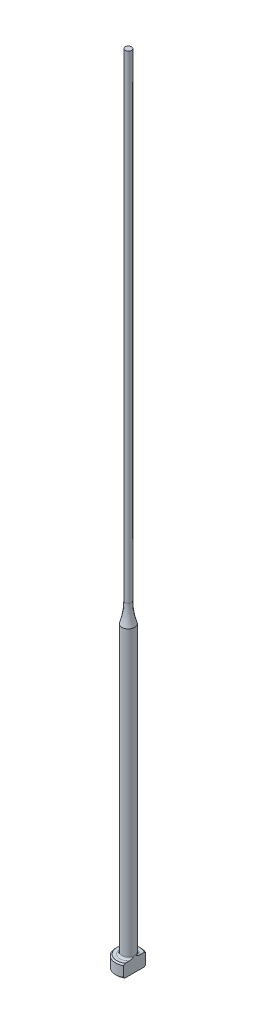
ISO-10303-21;
HEADER;
FILE_DESCRIPTION(('STEP AP214'),'2;1');
FILE_NAME('part.step','',(''),(''),'','','');
FILE_SCHEMA(('AUTOMOTIVE_DESIGN { 1 0 10303 214 1 1 1 1 }'));
ENDSEC;
DATA;
#1=APPLICATION_CONTEXT('core data for automotive mechanical design processes');
#2=APPLICATION_PROTOCOL_DEFINITION('international standard','automotive_design',2000,#1);
#3=PRODUCT_CONTEXT('',#1,'mechanical');
#4=PRODUCT('Part','Part','',(#3));
#5=PRODUCT_RELATED_PRODUCT_CATEGORY('part','',(#4));
#6=PRODUCT_DEFINITION_FORMATION('','',#4);
#7=PRODUCT_DEFINITION_CONTEXT('part definition',#1,'design');
#8=PRODUCT_DEFINITION('design','',#6,#7);
#9=PRODUCT_DEFINITION_SHAPE('','',#8);
#10=(LENGTH_UNIT() NAMED_UNIT(*) SI_UNIT(.MILLI.,.METRE.));
#11=(NAMED_UNIT(*) PLANE_ANGLE_UNIT() SI_UNIT($,.RADIAN.));
#12=(NAMED_UNIT(*) SI_UNIT($,.STERADIAN.) SOLID_ANGLE_UNIT());
#13=UNCERTAINTY_MEASURE_WITH_UNIT(LENGTH_MEASURE(1.E-05),#10,'distance_accuracy_value','');
#14=(GEOMETRIC_REPRESENTATION_CONTEXT(3) GLOBAL_UNCERTAINTY_ASSIGNED_CONTEXT((#13)) GLOBAL_UNIT_ASSIGNED_CONTEXT((#10,
#11,#12)) REPRESENTATION_CONTEXT('',''));
#15=CARTESIAN_POINT('',(0.,0.,0.));
#16=DIRECTION('',(0.,0.,1.));
#17=DIRECTION('',(1.,0.,0.));
#18=AXIS2_PLACEMENT_3D('',#15,#16,#17);
#19=CARTESIAN_POINT('',(-1.99999999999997,2.,0.));
#20=DIRECTION('',(0.,1.,0.));
#21=DIRECTION('',(0.,0.,1.));
#22=AXIS2_PLACEMENT_3D('',#19,#20,#21);
#23=PLANE('',#22);
#24=CARTESIAN_POINT('',(0.,2.,0.));
#25=DIRECTION('',(0.,1.,0.));
#26=DIRECTION('',(0.,0.,1.));
#27=AXIS2_PLACEMENT_3D('',#24,#25,#26);
#28=CIRCLE('',#27,1.79999999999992);
#29=CARTESIAN_POINT('',(0.999999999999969,2.,-1.4966629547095));
#30=VERTEX_POINT('',#29);
#31=CARTESIAN_POINT('',(0.999999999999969,2.,1.4966629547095));
#32=VERTEX_POINT('',#31);
#33=EDGE_CURVE('E187',#30,#32,#28,.T.);
#34=ORIENTED_EDGE('',*,*,#33,.T.);
#35=DIRECTION('',(0.,0.,-1.));
#36=VECTOR('',#35,1.);
#37=CARTESIAN_POINT('',(0.999999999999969,2.,0.));
#38=LINE('',#37,#36);
#39=CARTESIAN_POINT('',(0.999999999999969,2.00000000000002,0.830662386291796));
#40=VERTEX_POINT('',#39);
#41=EDGE_CURVE('E57',#32,#40,#38,.T.);
#42=ORIENTED_EDGE('',*,*,#41,.T.);
#43=CARTESIAN_POINT('',(0.,2.,0.));
#44=DIRECTION('',(0.,1.,0.));
#45=DIRECTION('',(0.,0.,1.));
#46=AXIS2_PLACEMENT_3D('',#43,#44,#45);
#47=CIRCLE('',#46,1.29999999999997);
#48=CARTESIAN_POINT('',(0.999999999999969,2.00000000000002,-0.830662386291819));
#49=VERTEX_POINT('',#48);
#50=EDGE_CURVE('E108',#40,#49,#47,.F.);
#51=ORIENTED_EDGE('',*,*,#50,.T.);
#52=EDGE_CURVE('E137',#49,#30,#38,.T.);
#53=ORIENTED_EDGE('',*,*,#52,.T.);
#54=EDGE_LOOP('',(#34,#42,#51,#53));
#55=FACE_BOUND('',#54,.T.);
#56=ADVANCED_FACE('F32',(#55),#23,.T.);
#57=CARTESIAN_POINT('',(0.,259.958771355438,0.));
#58=DIRECTION('',(0.,1.,0.));
#59=DIRECTION('',(0.,0.,1.));
#60=AXIS2_PLACEMENT_3D('',#57,#58,#59);
#61=CYLINDRICAL_SURFACE('',#60,1.99999999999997);
#62=CARTESIAN_POINT('',(0.,1.79999999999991,0.));
#63=DIRECTION('',(0.,1.,0.));
#64=DIRECTION('',(0.,0.,1.));
#65=AXIS2_PLACEMENT_3D('',#62,#63,#64);
#66=CIRCLE('',#65,1.99999999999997);
#67=CARTESIAN_POINT('',(0.999999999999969,1.79999999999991,1.73205080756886));
#68=VERTEX_POINT('',#67);
#69=CARTESIAN_POINT('',(0.999999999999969,1.79999999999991,-1.73205080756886));
#70=VERTEX_POINT('',#69);
#71=EDGE_CURVE('E105',#68,#70,#66,.F.);
#72=ORIENTED_EDGE('',*,*,#71,.T.);
#73=DIRECTION('',(0.,-1.,0.));
#74=VECTOR('',#73,1.);
#75=CARTESIAN_POINT('',(0.999999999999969,125.,-1.73205080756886));
#76=LINE('',#75,#74);
#77=CARTESIAN_POINT('',(0.999999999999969,0.199999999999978,-1.73205080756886));
#78=VERTEX_POINT('',#77);
#79=EDGE_CURVE('E193',#70,#78,#76,.T.);
#80=ORIENTED_EDGE('',*,*,#79,.T.);
#81=CARTESIAN_POINT('',(0.,0.199999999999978,0.));
#82=DIRECTION('',(0.,-1.,0.));
#83=DIRECTION('',(0.,0.,-1.));
#84=AXIS2_PLACEMENT_3D('',#81,#82,#83);
#85=CIRCLE('',#84,1.99999999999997);
#86=CARTESIAN_POINT('',(0.999999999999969,0.199999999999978,1.73205080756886));
#87=VERTEX_POINT('',#86);
#88=EDGE_CURVE('E100',#78,#87,#85,.F.);
#89=ORIENTED_EDGE('',*,*,#88,.T.);
#90=DIRECTION('',(0.,-1.,0.));
#91=VECTOR('',#90,1.);
#92=CARTESIAN_POINT('',(0.999999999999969,125.,1.73205080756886));
#93=LINE('',#92,#91);
#94=EDGE_CURVE('E93',#68,#87,#93,.T.);
#95=ORIENTED_EDGE('',*,*,#94,.F.);
#96=EDGE_LOOP('',(#72,#80,#89,#95));
#97=FACE_BOUND('',#96,.T.);
#98=ADVANCED_FACE('F158',(#97),#61,.T.);
#99=CARTESIAN_POINT('',(0.,0.,0.));
#100=DIRECTION('',(0.,-1.,0.));
#101=DIRECTION('',(0.,0.,-1.));
#102=AXIS2_PLACEMENT_3D('',#99,#100,#101);
#103=PLANE('',#102);
#104=CARTESIAN_POINT('',(0.,0.,0.));
#105=DIRECTION('',(0.,-1.,0.));
#106=DIRECTION('',(0.,0.,-1.));
#107=AXIS2_PLACEMENT_3D('',#104,#105,#106);
#108=CIRCLE('',#107,1.8);
#109=CARTESIAN_POINT('',(0.999999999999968,0.,1.49666295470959));
#110=VERTEX_POINT('',#109);
#111=CARTESIAN_POINT('',(0.999999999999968,0.,-1.49666295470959));
#112=VERTEX_POINT('',#111);
#113=EDGE_CURVE('E98',#110,#112,#108,.T.);
#114=ORIENTED_EDGE('',*,*,#113,.T.);
#115=DIRECTION('',(0.,0.,1.));
#116=VECTOR('',#115,1.);
#117=CARTESIAN_POINT('',(0.999999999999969,0.,-1.73205080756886));
#118=LINE('',#117,#116);
#119=EDGE_CURVE('E83',#112,#110,#118,.T.);
#120=ORIENTED_EDGE('',*,*,#119,.T.);
#121=EDGE_LOOP('',(#114,#120));
#122=FACE_BOUND('',#121,.T.);
#123=ADVANCED_FACE('F103',(#122),#103,.T.);
#124=CARTESIAN_POINT('',(0.,2.,0.));
#125=DIRECTION('',(0.,-1.,0.));
#126=DIRECTION('',(0.,0.,-1.));
#127=AXIS2_PLACEMENT_3D('',#124,#125,#126);
#128=CONICAL_SURFACE('',#127,1.79999999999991,0.785398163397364);
#129=ORIENTED_EDGE('',*,*,#71,.F.);
#130=CARTESIAN_POINT('',(0.999999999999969,-0.143084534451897,3.81417299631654));
#131=CARTESIAN_POINT('',(0.999999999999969,-0.0593997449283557,3.72765647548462));
#132=CARTESIAN_POINT('',(0.999999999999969,0.0241940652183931,3.64105173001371));
#133=CARTESIAN_POINT('',(0.999999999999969,0.19114891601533,3.46761616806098));
#134=CARTESIAN_POINT('',(0.999999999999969,0.27450995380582,3.38078534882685));
#135=CARTESIAN_POINT('',(0.999999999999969,0.52424932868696,3.11979400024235));
#136=CARTESIAN_POINT('',(0.999999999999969,0.690198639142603,2.94522254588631));
#137=CARTESIAN_POINT('',(0.999999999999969,1.0169755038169,2.59782670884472));
#138=CARTESIAN_POINT('',(0.999999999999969,1.1778392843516,2.42503661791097));
#139=CARTESIAN_POINT('',(0.999999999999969,1.41669118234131,2.16364984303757));
#140=CARTESIAN_POINT('',(0.999999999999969,1.49589273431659,2.07616357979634));
#141=CARTESIAN_POINT('',(0.999999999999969,1.653138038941,1.90015721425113));
#142=CARTESIAN_POINT('',(0.999999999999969,1.73118183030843,1.81163714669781));
#143=CARTESIAN_POINT('',(0.999999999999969,1.85567318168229,1.66767927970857));
#144=CARTESIAN_POINT('',(0.999999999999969,1.90265415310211,1.61270332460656));
#145=CARTESIAN_POINT('',(0.999999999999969,1.99577882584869,1.50203557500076));
#146=CARTESIAN_POINT('',(0.999999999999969,2.04192244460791,1.44634371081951));
#147=CARTESIAN_POINT('',(0.999999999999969,2.13356596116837,1.33345480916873));
#148=CARTESIAN_POINT('',(0.999999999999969,2.17905399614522,1.27624810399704));
#149=CARTESIAN_POINT('',(0.999999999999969,2.26844283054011,1.1606097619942));
#150=CARTESIAN_POINT('',(0.999999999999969,2.31234379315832,1.1021782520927));
#151=CARTESIAN_POINT('',(0.999999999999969,2.39853453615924,0.982773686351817));
#152=CARTESIAN_POINT('',(0.999999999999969,2.44078986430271,0.92177554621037));
#153=CARTESIAN_POINT('',(0.999999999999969,2.5218781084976,0.79738711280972));
#154=CARTESIAN_POINT('',(0.999999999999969,2.56070631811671,0.733993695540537));
#155=CARTESIAN_POINT('',(0.999999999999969,2.63248592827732,0.604932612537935));
#156=CARTESIAN_POINT('',(0.999999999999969,2.66550424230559,0.539302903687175));
#157=CARTESIAN_POINT('',(0.999999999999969,2.72301550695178,0.404437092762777));
#158=CARTESIAN_POINT('',(0.999999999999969,2.74753707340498,0.335214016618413));
#159=CARTESIAN_POINT('',(0.999999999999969,2.77407110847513,0.231400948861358));
#160=CARTESIAN_POINT('',(0.999999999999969,2.78110742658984,0.198093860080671));
#161=CARTESIAN_POINT('',(0.999999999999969,2.79200506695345,0.130954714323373));
#162=CARTESIAN_POINT('',(0.999999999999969,2.79586666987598,0.0971227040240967));
#163=CARTESIAN_POINT('',(0.999999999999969,2.80013905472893,0.0293410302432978));
#164=CARTESIAN_POINT('',(0.999999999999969,2.80056046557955,-0.00460794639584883));
#165=CARTESIAN_POINT('',(0.999999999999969,2.79795882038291,-0.0723663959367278));
#166=CARTESIAN_POINT('',(0.999999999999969,2.79493547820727,-0.106175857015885));
#167=CARTESIAN_POINT('',(0.999999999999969,2.78105481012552,-0.206326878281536));
#168=CARTESIAN_POINT('',(0.999999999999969,2.76542146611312,-0.272037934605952));
#169=CARTESIAN_POINT('',(0.999999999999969,2.73477554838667,-0.368312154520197));
#170=CARTESIAN_POINT('',(0.999999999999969,2.72331063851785,-0.400123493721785));
#171=CARTESIAN_POINT('',(0.999999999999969,2.69840546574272,-0.462964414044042));
#172=CARTESIAN_POINT('',(0.999999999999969,2.68496560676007,-0.493994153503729));
#173=CARTESIAN_POINT('',(0.999999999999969,2.64209309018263,-0.586298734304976));
#174=CARTESIAN_POINT('',(0.999999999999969,2.61022871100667,-0.64643570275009));
#175=CARTESIAN_POINT('',(0.999999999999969,2.54228534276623,-0.76430433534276));
#176=CARTESIAN_POINT('',(0.999999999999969,2.50620119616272,-0.822032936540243));
#177=CARTESIAN_POINT('',(0.999999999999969,2.43107084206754,-0.935840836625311));
#178=CARTESIAN_POINT('',(0.999999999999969,2.39201347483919,-0.991912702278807));
#179=CARTESIAN_POINT('',(0.999999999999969,2.31195870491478,-1.10259849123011));
#180=CARTESIAN_POINT('',(0.999999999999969,2.27096226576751,-1.15721311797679));
#181=CARTESIAN_POINT('',(0.999999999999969,2.18701695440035,-1.26606869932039));
#182=CARTESIAN_POINT('',(0.999999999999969,2.14404946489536,-1.32029522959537));
#183=CARTESIAN_POINT('',(0.999999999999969,2.05705050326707,-1.42788988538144));
#184=CARTESIAN_POINT('',(0.999999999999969,2.01301896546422,-1.48125795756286));
#185=CARTESIAN_POINT('',(0.999999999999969,1.8799506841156,-1.64010952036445));
#186=CARTESIAN_POINT('',(0.999999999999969,1.78973357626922,-1.74460261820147));
#187=CARTESIAN_POINT('',(0.999999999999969,1.62290341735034,-1.9342683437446));
#188=CARTESIAN_POINT('',(0.999999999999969,1.54658658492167,-2.01970404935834));
#189=CARTESIAN_POINT('',(0.999999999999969,1.39301250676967,-2.18973019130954));
#190=CARTESIAN_POINT('',(0.999999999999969,1.31575523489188,-2.27432060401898));
#191=CARTESIAN_POINT('',(0.999999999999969,1.08283440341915,-2.52732479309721));
#192=CARTESIAN_POINT('',(0.999999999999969,0.926165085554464,-2.69481086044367));
#193=CARTESIAN_POINT('',(0.999999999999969,0.617772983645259,-3.0214725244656));
#194=CARTESIAN_POINT('',(0.999999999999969,0.466111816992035,-3.18070657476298));
#195=CARTESIAN_POINT('',(0.999999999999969,0.238015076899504,-3.41880818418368));
#196=CARTESIAN_POINT('',(0.999999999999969,0.161924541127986,-3.49800657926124));
#197=CARTESIAN_POINT('',(0.999999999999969,0.00955322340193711,-3.65621892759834));
#198=CARTESIAN_POINT('',(0.999999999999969,-0.0667275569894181,-3.73523288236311));
#199=CARTESIAN_POINT('',(0.999999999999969,-0.143084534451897,-3.81417299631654));
#200=B_SPLINE_CURVE_WITH_KNOTS('',3,(#130,#131,#132,#133,#134,#135,#136,#137,#138,#139,#140,
#141,#142,#143,#144,#145,#146,#147,#148,#149,#150,#151,#152,#153,#154,#155,#156,#157,#158,#159,
#160,#161,#162,#163,#164,#165,#166,#167,#168,#169,#170,#171,#172,#173,#174,#175,#176,#177,#178,
#179,#180,#181,#182,#183,#184,#185,#186,#187,#188,#189,#190,#191,#192,#193,#194,#195,#196,#197,
#198,#199),.UNSPECIFIED.,.F.,.F.,(4,2,2,2,2,2,2,2,2,2,2,2,2,2,2,2,2,2,2,2,2,2,2,2,2,2,2,2,2,2,2,
2,2,2,4),(0.,0.361101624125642,0.722207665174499,1.44478731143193,2.15299784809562,
2.50702638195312,2.86104304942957,3.07798416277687,3.29494655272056,3.51418925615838,
3.73340935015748,3.95594813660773,4.17878792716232,4.3988639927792,4.6181915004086,
4.72018864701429,4.82217677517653,4.92384967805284,5.02553102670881,5.22698459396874,
5.32838854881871,5.4297717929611,5.63365200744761,5.83778406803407,6.04272417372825,
6.24756349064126,6.4551039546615,6.66265726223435,7.07676259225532,7.42043039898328,
7.76410778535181,8.45210822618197,9.11180822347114,9.44129145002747,9.77077197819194),.UNSPECIFIED.);
#201=EDGE_CURVE('E136',#68,#32,#200,.T.);
#202=ORIENTED_EDGE('',*,*,#201,.T.);
#203=ORIENTED_EDGE('',*,*,#33,.F.);
#204=EDGE_CURVE('E128',#30,#70,#200,.T.);
#205=ORIENTED_EDGE('',*,*,#204,.T.);
#206=EDGE_LOOP('',(#129,#202,#203,#205));
#207=FACE_BOUND('',#206,.T.);
#208=ADVANCED_FACE('F144',(#207),#128,.T.);
#209=CARTESIAN_POINT('',(0.,0.199999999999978,0.));
#210=DIRECTION('',(0.,1.,0.));
#211=DIRECTION('',(0.,0.,1.));
#212=AXIS2_PLACEMENT_3D('',#209,#210,#211);
#213=CONICAL_SURFACE('',#212,1.99999999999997,0.785398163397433);
#214=ORIENTED_EDGE('',*,*,#88,.F.);
#215=CARTESIAN_POINT('',(0.999999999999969,2.14308453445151,-3.81417299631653));
#216=CARTESIAN_POINT('',(0.999999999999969,2.05939974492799,-3.72765647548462));
#217=CARTESIAN_POINT('',(0.999999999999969,1.97580593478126,-3.64105173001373));
#218=CARTESIAN_POINT('',(0.999999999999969,1.80885108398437,-3.46761616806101));
#219=CARTESIAN_POINT('',(0.999999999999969,1.7254900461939,-3.38078534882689));
#220=CARTESIAN_POINT('',(0.999999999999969,1.47575067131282,-3.11979400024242));
#221=CARTESIAN_POINT('',(0.999999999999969,1.30980136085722,-2.94522254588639));
#222=CARTESIAN_POINT('',(0.999999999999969,0.983024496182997,-2.59782670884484));
#223=CARTESIAN_POINT('',(0.999999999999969,0.822160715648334,-2.42503661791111));
#224=CARTESIAN_POINT('',(0.999999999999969,0.583308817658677,-2.16364984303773));
#225=CARTESIAN_POINT('',(0.999999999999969,0.504107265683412,-2.07616357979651));
#226=CARTESIAN_POINT('',(0.999999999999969,0.34686196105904,-1.90015721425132));
#227=CARTESIAN_POINT('',(0.999999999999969,0.268818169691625,-1.81163714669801));
#228=CARTESIAN_POINT('',(0.999999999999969,0.144326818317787,-1.66767927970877));
#229=CARTESIAN_POINT('',(0.999999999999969,0.097345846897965,-1.61270332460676));
#230=CARTESIAN_POINT('',(0.999999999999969,0.00422117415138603,-1.50203557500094));
#231=CARTESIAN_POINT('',(0.999999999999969,-0.0419224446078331,-1.44634371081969));
#232=CARTESIAN_POINT('',(0.999999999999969,-0.133565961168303,-1.33345480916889));
#233=CARTESIAN_POINT('',(0.999999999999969,-0.179053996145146,-1.2762481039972));
#234=CARTESIAN_POINT('',(0.999999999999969,-0.268442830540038,-1.16060976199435));
#235=CARTESIAN_POINT('',(0.999999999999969,-0.312343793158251,-1.10217825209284));
#236=CARTESIAN_POINT('',(0.999999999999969,-0.398534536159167,-0.982773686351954));
#237=CARTESIAN_POINT('',(0.999999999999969,-0.440789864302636,-0.921775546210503));
#238=CARTESIAN_POINT('',(0.999999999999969,-0.521878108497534,-0.797387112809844));
#239=CARTESIAN_POINT('',(0.999999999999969,-0.560706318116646,-0.733993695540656));
#240=CARTESIAN_POINT('',(0.999999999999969,-0.632485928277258,-0.604932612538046));
#241=CARTESIAN_POINT('',(0.999999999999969,-0.665504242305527,-0.539302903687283));
#242=CARTESIAN_POINT('',(0.999999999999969,-0.723015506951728,-0.404437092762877));
#243=CARTESIAN_POINT('',(0.999999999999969,-0.747537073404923,-0.335214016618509));
#244=CARTESIAN_POINT('',(0.999999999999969,-0.774071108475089,-0.231400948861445));
#245=CARTESIAN_POINT('',(0.999999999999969,-0.781107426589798,-0.198093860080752));
#246=CARTESIAN_POINT('',(0.999999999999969,-0.792005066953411,-0.130954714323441));
#247=CARTESIAN_POINT('',(0.999999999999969,-0.795866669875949,-0.097122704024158));
#248=CARTESIAN_POINT('',(0.999999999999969,-0.800139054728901,-0.0293410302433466));
#249=CARTESIAN_POINT('',(0.999999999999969,-0.800560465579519,0.00460794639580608));
#250=CARTESIAN_POINT('',(0.999999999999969,-0.797958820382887,0.0723663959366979));
#251=CARTESIAN_POINT('',(0.999999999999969,-0.794935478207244,0.106175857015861));
#252=CARTESIAN_POINT('',(0.999999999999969,-0.78105481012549,0.206326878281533));
#253=CARTESIAN_POINT('',(0.999999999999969,-0.765421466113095,0.272037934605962));
#254=CARTESIAN_POINT('',(0.999999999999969,-0.734775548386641,0.368312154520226));
#255=CARTESIAN_POINT('',(0.999999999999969,-0.723310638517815,0.40012349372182));
#256=CARTESIAN_POINT('',(0.999999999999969,-0.698405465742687,0.46296441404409));
#257=CARTESIAN_POINT('',(0.999999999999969,-0.684965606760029,0.493994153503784));
#258=CARTESIAN_POINT('',(0.999999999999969,-0.642093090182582,0.586298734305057));
#259=CARTESIAN_POINT('',(0.999999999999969,-0.610228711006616,0.64643570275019));
#260=CARTESIAN_POINT('',(0.999999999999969,-0.542285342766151,0.764304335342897));
#261=CARTESIAN_POINT('',(0.999999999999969,-0.506201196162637,0.822032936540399));
#262=CARTESIAN_POINT('',(0.999999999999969,-0.431070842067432,0.935840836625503));
#263=CARTESIAN_POINT('',(0.999999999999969,-0.392013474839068,0.991912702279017));
#264=CARTESIAN_POINT('',(0.999999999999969,-0.311958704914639,1.10259849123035));
#265=CARTESIAN_POINT('',(0.999999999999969,-0.27096226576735,1.15721311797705));
#266=CARTESIAN_POINT('',(0.999999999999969,-0.187016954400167,1.26606869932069));
#267=CARTESIAN_POINT('',(0.999999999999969,-0.144049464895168,1.32029522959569));
#268=CARTESIAN_POINT('',(0.999999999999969,-0.0570505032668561,1.4278898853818));
#269=CARTESIAN_POINT('',(0.999999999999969,-0.0130189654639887,1.48125795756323));
#270=CARTESIAN_POINT('',(0.999999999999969,0.120049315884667,1.64010952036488));
#271=CARTESIAN_POINT('',(0.999999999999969,0.21026642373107,1.74460261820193));
#272=CARTESIAN_POINT('',(0.999999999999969,0.377096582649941,1.93426834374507));
#273=CARTESIAN_POINT('',(0.999999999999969,0.453413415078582,2.01970404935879));
#274=CARTESIAN_POINT('',(0.999999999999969,0.606987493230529,2.18973019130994));
#275=CARTESIAN_POINT('',(0.999999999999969,0.684244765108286,2.27432060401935));
#276=CARTESIAN_POINT('',(0.999999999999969,0.917165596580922,2.52732479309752));
#277=CARTESIAN_POINT('',(0.999999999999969,1.07383491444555,2.69481086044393));
#278=CARTESIAN_POINT('',(0.999999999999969,1.38222701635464,3.02147252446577));
#279=CARTESIAN_POINT('',(0.999999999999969,1.53388818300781,3.18070657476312));
#280=CARTESIAN_POINT('',(0.999999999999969,1.76198492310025,3.41880818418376));
#281=CARTESIAN_POINT('',(0.999999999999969,1.83807545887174,3.49800657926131));
#282=CARTESIAN_POINT('',(0.999999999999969,1.99044677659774,3.65621892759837));
#283=CARTESIAN_POINT('',(0.999999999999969,2.06672755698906,3.73523288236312));
#284=CARTESIAN_POINT('',(0.999999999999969,2.14308453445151,3.81417299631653));
#285=B_SPLINE_CURVE_WITH_KNOTS('',3,(#215,#216,#217,#218,#219,#220,#221,#222,#223,#224,#225,
#226,#227,#228,#229,#230,#231,#232,#233,#234,#235,#236,#237,#238,#239,#240,#241,#242,#243,#244,
#245,#246,#247,#248,#249,#250,#251,#252,#253,#254,#255,#256,#257,#258,#259,#260,#261,#262,#263,
#264,#265,#266,#267,#268,#269,#270,#271,#272,#273,#274,#275,#276,#277,#278,#279,#280,#281,#282,
#283,#284),.UNSPECIFIED.,.F.,.F.,(4,2,2,2,2,2,2,2,2,2,2,2,2,2,2,2,2,2,2,2,2,2,2,2,2,2,2,2,2,2,2,
2,2,2,4),(0.,0.36110162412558,0.722207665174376,1.44478731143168,2.15299784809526,
2.5070263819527,2.8610430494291,3.07798416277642,3.29494655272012,3.51418925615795,
3.73340935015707,3.95594813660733,4.17878792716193,4.39886399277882,4.61819150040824,
4.72018864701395,4.82217677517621,4.92384967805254,5.02553102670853,5.22698459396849,
5.32838854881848,5.42977179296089,5.63365200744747,5.83778406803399,6.04272417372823,
6.24756349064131,6.45510395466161,6.66265726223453,7.07676259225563,7.42043039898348,
7.7641077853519,8.45210822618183,9.1118082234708,9.44129145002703,9.77077197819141),.UNSPECIFIED.);
#286=EDGE_CURVE('E86',#78,#112,#285,.T.);
#287=ORIENTED_EDGE('',*,*,#286,.T.);
#288=ORIENTED_EDGE('',*,*,#113,.F.);
#289=EDGE_CURVE('E89',#110,#87,#285,.T.);
#290=ORIENTED_EDGE('',*,*,#289,.T.);
#291=EDGE_LOOP('',(#214,#287,#288,#290));
#292=FACE_BOUND('',#291,.T.);
#293=ADVANCED_FACE('F97',(#292),#213,.T.);
#294=CARTESIAN_POINT('',(0.,2.30000000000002,0.));
#295=DIRECTION('',(0.,1.,0.));
#296=DIRECTION('',(0.,0.,1.));
#297=AXIS2_PLACEMENT_3D('',#294,#295,#296);
#298=TOROIDAL_SURFACE('',#297,1.29999999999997,0.3);
#299=CARTESIAN_POINT('',(0.999999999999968,2.30000000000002,0.));
#300=CARTESIAN_POINT('',(0.999999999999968,2.30000064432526,8.6574445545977E-12));
#301=CARTESIAN_POINT('',(0.999999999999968,2.30000128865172,-9.05742231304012E-08));
#302=CARTESIAN_POINT('',(0.999999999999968,2.30000254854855,-3.98319620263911E-07));
#303=CARTESIAN_POINT('',(0.999999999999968,2.30000316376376,-6.16748313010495E-07));
#304=CARTESIAN_POINT('',(0.999999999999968,2.30000438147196,-1.15047367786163E-06));
#305=CARTESIAN_POINT('',(0.999999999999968,2.30000498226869,-1.46954564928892E-06));
#306=CARTESIAN_POINT('',(0.999999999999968,2.30000613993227,-2.17388585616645E-06));
#307=CARTESIAN_POINT('',(0.999999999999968,2.3000066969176,-2.55896592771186E-06));
#308=CARTESIAN_POINT('',(0.999999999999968,2.30000847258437,-3.89137454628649E-06));
#309=CARTESIAN_POINT('',(0.999999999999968,2.30000962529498,-4.9272569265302E-06));
#310=CARTESIAN_POINT('',(0.999999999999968,2.30001175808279,-7.12255376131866E-06));
#311=CARTESIAN_POINT('',(0.999999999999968,2.30001274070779,-8.27963246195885E-06));
#312=CARTESIAN_POINT('',(0.999999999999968,2.30001619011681,-1.25710396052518E-05));
#313=CARTESIAN_POINT('',(0.999999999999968,2.30001847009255,-1.58589994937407E-05));
#314=CARTESIAN_POINT('',(0.999999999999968,2.3000224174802,-2.25210462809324E-05));
#315=CARTESIAN_POINT('',(0.999999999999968,2.30002411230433,-2.58796667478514E-05));
#316=CARTESIAN_POINT('',(0.999999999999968,2.30003085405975,-3.94941957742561E-05));
#317=CARTESIAN_POINT('',(0.999999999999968,2.30003568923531,-4.98493079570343E-05));
#318=CARTESIAN_POINT('',(0.999999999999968,2.30004388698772,-6.96407730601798E-05));
#319=CARTESIAN_POINT('',(0.999999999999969,2.30004735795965,-7.903098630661E-05));
#320=CARTESIAN_POINT('',(0.999999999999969,2.30007348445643,-0.000144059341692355));
#321=CARTESIAN_POINT('',(0.999999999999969,2.30010510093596,-0.000195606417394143));
#322=CARTESIAN_POINT('',(0.999999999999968,2.30022061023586,-0.000391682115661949));
#323=CARTESIAN_POINT('',(0.999999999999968,2.3002978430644,-0.000539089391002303));
#324=CARTESIAN_POINT('',(0.999999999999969,2.30059433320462,-0.00109591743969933));
#325=CARTESIAN_POINT('',(0.999999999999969,2.30082052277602,-0.00150237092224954));
#326=CARTESIAN_POINT('',(0.999999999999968,2.30171558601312,-0.00311941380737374));
#327=CARTESIAN_POINT('',(0.999999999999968,2.30237677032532,-0.00433326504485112));
#328=CARTESIAN_POINT('',(0.999999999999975,2.31602135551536,-0.0293725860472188));
#329=CARTESIAN_POINT('',(0.99999999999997,2.32909104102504,-0.0531623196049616));
#330=CARTESIAN_POINT('',(0.999999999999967,2.35458080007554,-0.100088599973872));
#331=CARTESIAN_POINT('',(0.999999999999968,2.36700820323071,-0.123221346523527));
#332=CARTESIAN_POINT('',(0.999999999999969,2.39281545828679,-0.172044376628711));
#333=CARTESIAN_POINT('',(0.999999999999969,2.4061616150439,-0.197752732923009));
#334=CARTESIAN_POINT('',(0.999999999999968,2.4323541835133,-0.249714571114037));
#335=CARTESIAN_POINT('',(0.999999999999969,2.44519503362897,-0.27597087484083));
#336=CARTESIAN_POINT('',(0.999999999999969,2.46718175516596,-0.322864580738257));
#337=CARTESIAN_POINT('',(0.999999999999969,2.47650292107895,-0.34341923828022));
#338=CARTESIAN_POINT('',(0.999999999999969,2.49448113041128,-0.384761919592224));
#339=CARTESIAN_POINT('',(0.999999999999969,2.50313958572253,-0.405549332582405));
#340=CARTESIAN_POINT('',(0.999999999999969,2.5276434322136,-0.467585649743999));
#341=CARTESIAN_POINT('',(0.999999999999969,2.54239224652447,-0.509286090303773));
#342=CARTESIAN_POINT('',(0.999999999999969,2.56458900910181,-0.58349816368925));
#343=CARTESIAN_POINT('',(0.999999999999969,2.57294045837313,-0.61573699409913));
#344=CARTESIAN_POINT('',(0.999999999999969,2.58691787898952,-0.682155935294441));
#345=CARTESIAN_POINT('',(0.999999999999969,2.5924232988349,-0.716362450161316));
#346=CARTESIAN_POINT('',(0.999999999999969,2.59932200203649,-0.784996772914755));
#347=CARTESIAN_POINT('',(0.999999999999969,2.60074119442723,-0.819421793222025));
#348=CARTESIAN_POINT('',(0.999999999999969,2.59853032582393,-0.88779225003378));
#349=CARTESIAN_POINT('',(0.999999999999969,2.59495737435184,-0.921738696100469));
#350=CARTESIAN_POINT('',(0.999999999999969,2.58381038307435,-0.977927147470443));
#351=CARTESIAN_POINT('',(0.999999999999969,2.57785171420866,-1.00048693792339));
#352=CARTESIAN_POINT('',(0.999999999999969,2.56267132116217,-1.0445512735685));
#353=CARTESIAN_POINT('',(0.999999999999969,2.55344592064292,-1.06605459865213));
#354=CARTESIAN_POINT('',(0.999999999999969,2.53348156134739,-1.10327564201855));
#355=CARTESIAN_POINT('',(0.999999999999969,2.52335553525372,-1.11931996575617));
#356=CARTESIAN_POINT('',(0.999999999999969,2.50063930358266,-1.1495565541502));
#357=CARTESIAN_POINT('',(0.999999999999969,2.48805327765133,-1.16375189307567));
#358=CARTESIAN_POINT('',(0.999999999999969,2.46313284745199,-1.18709127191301));
#359=CARTESIAN_POINT('',(0.999999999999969,2.45121755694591,-1.19668155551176));
#360=CARTESIAN_POINT('',(0.999999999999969,2.4259612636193,-1.21377371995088));
#361=CARTESIAN_POINT('',(0.999999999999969,2.41262072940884,-1.2212762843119));
#362=CARTESIAN_POINT('',(0.999999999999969,2.38471163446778,-1.23381879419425));
#363=CARTESIAN_POINT('',(0.999999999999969,2.3701356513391,-1.23884240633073));
#364=CARTESIAN_POINT('',(0.999999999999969,2.34029120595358,-1.2460136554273));
#365=CARTESIAN_POINT('',(0.999999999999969,2.32502317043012,-1.24816304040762));
#366=CARTESIAN_POINT('',(0.999999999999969,2.29609418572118,-1.24936303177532));
#367=CARTESIAN_POINT('',(0.999999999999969,2.28244572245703,-1.24873511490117));
#368=CARTESIAN_POINT('',(0.999999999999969,2.25546467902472,-1.24513625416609));
#369=CARTESIAN_POINT('',(0.999999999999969,2.2421320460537,-1.24216570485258));
#370=CARTESIAN_POINT('',(0.999999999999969,2.21644742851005,-1.23414136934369));
#371=CARTESIAN_POINT('',(0.999999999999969,2.20408009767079,-1.22913614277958));
#372=CARTESIAN_POINT('',(0.999999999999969,2.18026539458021,-1.2172891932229));
#373=CARTESIAN_POINT('',(0.999999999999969,2.16881815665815,-1.21044720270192));
#374=CARTESIAN_POINT('',(0.999999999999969,2.14602713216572,-1.19450929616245));
#375=CARTESIAN_POINT('',(0.999999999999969,2.1347876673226,-1.18526487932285));
#376=CARTESIAN_POINT('',(0.999999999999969,2.11372805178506,-1.16528066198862));
#377=CARTESIAN_POINT('',(0.999999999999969,2.1039092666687,-1.15453944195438));
#378=CARTESIAN_POINT('',(0.999999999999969,2.08131380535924,-1.12639326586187));
#379=CARTESIAN_POINT('',(0.999999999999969,2.06941227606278,-1.10828305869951));
#380=CARTESIAN_POINT('',(0.999999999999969,2.04871157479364,-1.07041295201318));
#381=CARTESIAN_POINT('',(0.999999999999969,2.03991325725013,-1.05065259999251));
#382=CARTESIAN_POINT('',(0.999999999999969,2.02219264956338,-1.00203188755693));
#383=CARTESIAN_POINT('',(0.999999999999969,2.01461756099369,-0.972682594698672));
#384=CARTESIAN_POINT('',(0.999999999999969,2.00410660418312,-0.912914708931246));
#385=CARTESIAN_POINT('',(0.999999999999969,2.00122174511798,-0.882487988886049));
#386=CARTESIAN_POINT('',(0.999999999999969,1.99886242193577,-0.80318909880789));
#387=CARTESIAN_POINT('',(0.999999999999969,2.0024814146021,-0.754226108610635));
#388=CARTESIAN_POINT('',(0.999999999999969,2.01327071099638,-0.682724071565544));
#389=CARTESIAN_POINT('',(0.999999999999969,2.01762186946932,-0.659663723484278));
#390=CARTESIAN_POINT('',(0.999999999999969,2.02775671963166,-0.613959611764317));
#391=CARTESIAN_POINT('',(0.999999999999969,2.03353398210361,-0.59131445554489));
#392=CARTESIAN_POINT('',(0.999999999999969,2.05232003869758,-0.525222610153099));
#393=CARTESIAN_POINT('',(0.999999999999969,2.0670175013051,-0.482256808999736));
#394=CARTESIAN_POINT('',(0.999999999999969,2.09166172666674,-0.418361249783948));
#395=CARTESIAN_POINT('',(0.999999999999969,2.10040936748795,-0.396945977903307));
#396=CARTESIAN_POINT('',(0.999999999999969,2.11862724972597,-0.354367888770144));
#397=CARTESIAN_POINT('',(0.999999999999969,2.12809902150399,-0.33320572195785));
#398=CARTESIAN_POINT('',(0.999999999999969,2.15054796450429,-0.284809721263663));
#399=CARTESIAN_POINT('',(0.999999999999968,2.16372144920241,-0.257667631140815));
#400=CARTESIAN_POINT('',(0.999999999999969,2.19063957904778,-0.203972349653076));
#401=CARTESIAN_POINT('',(0.999999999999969,2.20437810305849,-0.177416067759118));
#402=CARTESIAN_POINT('',(0.999999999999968,2.23096755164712,-0.127000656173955));
#403=CARTESIAN_POINT('',(0.999999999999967,2.2437812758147,-0.103121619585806));
#404=CARTESIAN_POINT('',(0.99999999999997,2.27007504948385,-0.0546869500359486));
#405=CARTESIAN_POINT('',(0.999999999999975,2.28356304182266,-0.0301354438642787));
#406=CARTESIAN_POINT('',(0.999999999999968,2.29762327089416,-0.00433318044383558));
#407=CARTESIAN_POINT('',(0.999999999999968,2.29828450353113,-0.00311924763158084));
#408=CARTESIAN_POINT('',(0.999999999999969,2.29917957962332,-0.0015021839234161));
#409=CARTESIAN_POINT('',(0.999999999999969,2.2994057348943,-0.0010957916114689));
#410=CARTESIAN_POINT('',(0.999999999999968,2.29970218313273,-0.000539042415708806));
#411=CARTESIAN_POINT('',(0.999999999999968,2.29977940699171,-0.000391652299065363));
#412=CARTESIAN_POINT('',(0.999999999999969,2.29989490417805,-0.000195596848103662));
#413=CARTESIAN_POINT('',(0.999999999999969,2.2999265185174,-0.000144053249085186));
#414=CARTESIAN_POINT('',(0.999999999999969,2.29995264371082,-7.90290824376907E-05));
#415=CARTESIAN_POINT('',(0.999999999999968,2.29995611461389,-6.96391975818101E-05));
#416=CARTESIAN_POINT('',(0.999999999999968,2.29996431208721,-4.98484228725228E-05));
#417=CARTESIAN_POINT('',(0.999999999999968,2.29996914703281,-3.94936645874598E-05));
#418=CARTESIAN_POINT('',(0.999999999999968,2.29997588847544,-2.587953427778E-05));
#419=CARTESIAN_POINT('',(0.999999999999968,2.29997758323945,-2.25209724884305E-05));
#420=CARTESIAN_POINT('',(0.999999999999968,2.29998153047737,-1.58590310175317E-05));
#421=CARTESIAN_POINT('',(0.999999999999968,2.29998381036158,-1.25711163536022E-05));
#422=CARTESIAN_POINT('',(0.999999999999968,2.29998725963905,-8.27974911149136E-06));
#423=CARTESIAN_POINT('',(0.999999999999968,2.29998824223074,-7.122675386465E-06));
#424=CARTESIAN_POINT('',(0.999999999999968,2.29999037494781,-4.92738159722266E-06));
#425=CARTESIAN_POINT('',(0.999999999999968,2.29999152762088,-3.89149712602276E-06));
#426=CARTESIAN_POINT('',(0.999999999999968,2.29999330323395,-2.5590774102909E-06));
#427=CARTESIAN_POINT('',(0.999999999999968,2.29999386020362,-2.17399250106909E-06));
#428=CARTESIAN_POINT('',(0.999999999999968,2.29999501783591,-1.4696398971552E-06));
#429=CARTESIAN_POINT('',(0.999999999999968,2.299995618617,-1.15056035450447E-06));
#430=CARTESIAN_POINT('',(0.999999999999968,2.29999683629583,-6.16816558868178E-07));
#431=CARTESIAN_POINT('',(0.999999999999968,2.29999745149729,-3.98377208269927E-07));
#432=CARTESIAN_POINT('',(0.999999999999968,2.29999871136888,-9.06063088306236E-08));
#433=CARTESIAN_POINT('',(0.999999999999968,2.29999935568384,-8.657323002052E-12));
#434=CARTESIAN_POINT('',(0.999999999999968,2.30000000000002,0.));
#435=B_SPLINE_CURVE_WITH_KNOTS('',3,(#299,#300,#301,#302,#303,#304,#305,#306,#307,#308,#309,
#310,#311,#312,#313,#314,#315,#316,#317,#318,#319,#320,#321,#322,#323,#324,#325,#326,#327,#328,
#329,#330,#331,#332,#333,#334,#335,#336,#337,#338,#339,#340,#341,#342,#343,#344,#345,#346,#347,
#348,#349,#350,#351,#352,#353,#354,#355,#356,#357,#358,#359,#360,#361,#362,#363,#364,#365,#366,
#367,#368,#369,#370,#371,#372,#373,#374,#375,#376,#377,#378,#379,#380,#381,#382,#383,#384,#385,
#386,#387,#388,#389,#390,#391,#392,#393,#394,#395,#396,#397,#398,#399,#400,#401,#402,#403,#404,
#405,#406,#407,#408,#409,#410,#411,#412,#413,#414,#415,#416,#417,#418,#419,#420,#421,#422,#423,
#424,#425,#426,#427,#428,#429,#430,#431,#432,#433,#434),.UNSPECIFIED.,.T.,.F.,(4,2,2,2,2,2,2,2,
2,2,2,2,2,2,2,2,2,2,2,2,2,2,2,2,2,2,2,2,2,2,2,2,2,2,2,2,2,2,2,2,2,2,2,2,2,2,2,2,2,2,2,2,2,2,2,2,
2,2,2,2,2,2,2,2,2,2,2,4),(0.,1.93088000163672E-06,3.88121487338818E-06,5.91576027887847E-06,
7.94459959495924E-06,1.25713540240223E-05,1.71213138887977E-05,2.9075120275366E-05,
4.0350817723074E-05,7.46190414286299E-05,0.000104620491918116,0.00028499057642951,
0.000785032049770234,0.00217951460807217,0.00632720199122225,0.0877445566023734,
0.166524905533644,0.253417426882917,0.341089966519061,0.408787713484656,0.476336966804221,
0.608850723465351,0.708652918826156,0.812393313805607,0.915474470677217,1.01738599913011,
1.08718721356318,1.15706723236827,1.21377727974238,1.27039179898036,1.31609373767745,
1.36178069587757,1.40776478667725,1.4537208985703,1.49450576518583,1.5352837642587,
1.57514089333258,1.61500383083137,1.65849635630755,1.70203041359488,1.76667915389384,
1.83134568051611,1.92177629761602,2.0131839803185,2.15955153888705,2.22993031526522,
2.29999742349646,2.43600819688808,2.50540041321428,2.57494356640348,2.66544006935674,
2.75513178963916,2.83643278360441,2.92045687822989,2.92460484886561,2.92599912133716,
2.926499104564,2.92667946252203,2.92670946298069,2.92674372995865,2.92675500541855,
2.92676695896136,2.92677150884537,2.92677613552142,2.92677816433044,2.92678019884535,
2.92678214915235,2.92678408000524),.UNSPECIFIED.);
#436=CARTESIAN_POINT('',(0.999999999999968,2.30000000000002,0.));
#437=VERTEX_POINT('',#436);
#438=EDGE_CURVE('E11',#49,#437,#435,.T.);
#439=ORIENTED_EDGE('',*,*,#438,.F.);
#440=ORIENTED_EDGE('',*,*,#50,.F.);
#441=CARTESIAN_POINT('',(0.999999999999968,2.30000000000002,0.));
#442=CARTESIAN_POINT('',(0.999999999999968,2.29999935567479,-8.65741696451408E-12));
#443=CARTESIAN_POINT('',(0.999999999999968,2.29999871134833,9.05742231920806E-08));
#444=CARTESIAN_POINT('',(0.999999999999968,2.2999974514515,3.98319620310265E-07));
#445=CARTESIAN_POINT('',(0.999999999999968,2.29999683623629,6.16748313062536E-07));
#446=CARTESIAN_POINT('',(0.999999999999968,2.29999561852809,1.15047367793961E-06));
#447=CARTESIAN_POINT('',(0.999999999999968,2.29999501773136,1.46954564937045E-06));
#448=CARTESIAN_POINT('',(0.999999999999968,2.29999386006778,2.17388585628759E-06));
#449=CARTESIAN_POINT('',(0.999999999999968,2.29999330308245,2.55896592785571E-06));
#450=CARTESIAN_POINT('',(0.999999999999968,2.29999152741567,3.89137454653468E-06));
#451=CARTESIAN_POINT('',(0.999999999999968,2.29999037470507,4.92725692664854E-06));
#452=CARTESIAN_POINT('',(0.999999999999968,2.29998824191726,7.12255376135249E-06));
#453=CARTESIAN_POINT('',(0.999999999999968,2.29998725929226,8.27963246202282E-06));
#454=CARTESIAN_POINT('',(0.999999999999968,2.29998380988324,1.25710396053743E-05));
#455=CARTESIAN_POINT('',(0.999999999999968,2.2999815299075,1.58589994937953E-05));
#456=CARTESIAN_POINT('',(0.999999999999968,2.29997758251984,2.25210462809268E-05));
#457=CARTESIAN_POINT('',(0.999999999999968,2.29997588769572,2.58796667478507E-05));
#458=CARTESIAN_POINT('',(0.999999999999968,2.29996914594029,3.94941957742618E-05));
#459=CARTESIAN_POINT('',(0.999999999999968,2.29996431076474,4.98493079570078E-05));
#460=CARTESIAN_POINT('',(0.999999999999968,2.29995611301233,6.96407730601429E-05));
#461=CARTESIAN_POINT('',(0.999999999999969,2.2999526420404,7.90309863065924E-05));
#462=CARTESIAN_POINT('',(0.999999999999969,2.29992651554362,0.000144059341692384));
#463=CARTESIAN_POINT('',(0.999999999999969,2.29989489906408,0.000195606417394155));
#464=CARTESIAN_POINT('',(0.999999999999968,2.29977938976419,0.000391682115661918));
#465=CARTESIAN_POINT('',(0.999999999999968,2.29970215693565,0.000539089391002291));
#466=CARTESIAN_POINT('',(0.999999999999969,2.29940566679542,0.00109591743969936));
#467=CARTESIAN_POINT('',(0.999999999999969,2.29917947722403,0.00150237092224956));
#468=CARTESIAN_POINT('',(0.999999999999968,2.29828441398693,0.0031194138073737));
#469=CARTESIAN_POINT('',(0.999999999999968,2.29762322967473,0.0043332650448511));
#470=CARTESIAN_POINT('',(0.999999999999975,2.28397864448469,0.0293725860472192));
#471=CARTESIAN_POINT('',(0.99999999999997,2.27090895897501,0.0531623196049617));
#472=CARTESIAN_POINT('',(0.999999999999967,2.24541919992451,0.100088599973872));
#473=CARTESIAN_POINT('',(0.999999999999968,2.23299179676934,0.123221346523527));
#474=CARTESIAN_POINT('',(0.999999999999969,2.20718454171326,0.172044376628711));
#475=CARTESIAN_POINT('',(0.999999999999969,2.19383838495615,0.197752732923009));
#476=CARTESIAN_POINT('',(0.999999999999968,2.16764581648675,0.249714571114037));
#477=CARTESIAN_POINT('',(0.999999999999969,2.15480496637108,0.27597087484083));
#478=CARTESIAN_POINT('',(0.999999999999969,2.13281824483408,0.322864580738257));
#479=CARTESIAN_POINT('',(0.999999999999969,2.1234970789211,0.34341923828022));
#480=CARTESIAN_POINT('',(0.999999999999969,2.10551886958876,0.384761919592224));
#481=CARTESIAN_POINT('',(0.999999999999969,2.09686041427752,0.405549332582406));
#482=CARTESIAN_POINT('',(0.999999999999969,2.07235656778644,0.467585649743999));
#483=CARTESIAN_POINT('',(0.999999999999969,2.05760775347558,0.509286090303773));
#484=CARTESIAN_POINT('',(0.999999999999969,2.03541099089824,0.58349816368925));
#485=CARTESIAN_POINT('',(0.999999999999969,2.02705954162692,0.61573699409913));
#486=CARTESIAN_POINT('',(0.999999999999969,2.01308212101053,0.682155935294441));
#487=CARTESIAN_POINT('',(0.999999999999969,2.00757670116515,0.716362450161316));
#488=CARTESIAN_POINT('',(0.999999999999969,2.00067799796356,0.784996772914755));
#489=CARTESIAN_POINT('',(0.999999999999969,1.99925880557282,0.819421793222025));
#490=CARTESIAN_POINT('',(0.999999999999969,2.00146967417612,0.88779225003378));
#491=CARTESIAN_POINT('',(0.999999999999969,2.00504262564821,0.921738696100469));
#492=CARTESIAN_POINT('',(0.999999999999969,2.0161896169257,0.977927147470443));
#493=CARTESIAN_POINT('',(0.999999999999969,2.02214828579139,1.00048693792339));
#494=CARTESIAN_POINT('',(0.999999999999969,2.03732867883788,1.0445512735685));
#495=CARTESIAN_POINT('',(0.999999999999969,2.04655407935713,1.06605459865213));
#496=CARTESIAN_POINT('',(0.999999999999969,2.06651843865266,1.10327564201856));
#497=CARTESIAN_POINT('',(0.999999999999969,2.07664446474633,1.11931996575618));
#498=CARTESIAN_POINT('',(0.999999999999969,2.09936069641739,1.14955655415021));
#499=CARTESIAN_POINT('',(0.999999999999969,2.11194672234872,1.16375189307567));
#500=CARTESIAN_POINT('',(0.999999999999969,2.13686715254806,1.18709127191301));
#501=CARTESIAN_POINT('',(0.999999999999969,2.14878244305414,1.19668155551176));
#502=CARTESIAN_POINT('',(0.999999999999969,2.17403873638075,1.21377371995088));
#503=CARTESIAN_POINT('',(0.999999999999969,2.18737927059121,1.2212762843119));
#504=CARTESIAN_POINT('',(0.999999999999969,2.21528836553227,1.23381879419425));
#505=CARTESIAN_POINT('',(0.999999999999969,2.22986434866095,1.23884240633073));
#506=CARTESIAN_POINT('',(0.999999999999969,2.25970879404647,1.2460136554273));
#507=CARTESIAN_POINT('',(0.999999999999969,2.27497682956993,1.24816304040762));
#508=CARTESIAN_POINT('',(0.999999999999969,2.30390581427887,1.24936303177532));
#509=CARTESIAN_POINT('',(0.999999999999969,2.31755427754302,1.24873511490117));
#510=CARTESIAN_POINT('',(0.999999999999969,2.34453532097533,1.24513625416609));
#511=CARTESIAN_POINT('',(0.999999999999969,2.35786795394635,1.24216570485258));
#512=CARTESIAN_POINT('',(0.999999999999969,2.38355257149,1.23414136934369));
#513=CARTESIAN_POINT('',(0.999999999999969,2.39591990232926,1.22913614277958));
#514=CARTESIAN_POINT('',(0.999999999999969,2.41973460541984,1.2172891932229));
#515=CARTESIAN_POINT('',(0.999999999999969,2.4311818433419,1.21044720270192));
#516=CARTESIAN_POINT('',(0.999999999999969,2.45397286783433,1.19450929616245));
#517=CARTESIAN_POINT('',(0.999999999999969,2.46521233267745,1.18526487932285));
#518=CARTESIAN_POINT('',(0.999999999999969,2.48627194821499,1.16528066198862));
#519=CARTESIAN_POINT('',(0.999999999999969,2.49609073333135,1.15453944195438));
#520=CARTESIAN_POINT('',(0.999999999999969,2.51868619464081,1.12639326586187));
#521=CARTESIAN_POINT('',(0.999999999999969,2.53058772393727,1.10828305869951));
#522=CARTESIAN_POINT('',(0.999999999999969,2.55128842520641,1.07041295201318));
#523=CARTESIAN_POINT('',(0.999999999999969,2.56008674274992,1.05065259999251));
#524=CARTESIAN_POINT('',(0.999999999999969,2.57780735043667,1.00203188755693));
#525=CARTESIAN_POINT('',(0.999999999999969,2.58538243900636,0.972682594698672));
#526=CARTESIAN_POINT('',(0.999999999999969,2.59589339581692,0.912914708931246));
#527=CARTESIAN_POINT('',(0.999999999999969,2.59877825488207,0.882487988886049));
#528=CARTESIAN_POINT('',(0.999999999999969,2.60113757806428,0.80318909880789));
#529=CARTESIAN_POINT('',(0.999999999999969,2.59751858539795,0.754226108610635));
#530=CARTESIAN_POINT('',(0.999999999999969,2.58672928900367,0.682724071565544));
#531=CARTESIAN_POINT('',(0.999999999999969,2.58237813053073,0.659663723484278));
#532=CARTESIAN_POINT('',(0.999999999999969,2.57224328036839,0.613959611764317));
#533=CARTESIAN_POINT('',(0.999999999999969,2.56646601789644,0.59131445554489));
#534=CARTESIAN_POINT('',(0.999999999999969,2.54767996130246,0.525222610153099));
#535=CARTESIAN_POINT('',(0.999999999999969,2.53298249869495,0.482256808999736));
#536=CARTESIAN_POINT('',(0.999999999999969,2.50833827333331,0.418361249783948));
#537=CARTESIAN_POINT('',(0.999999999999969,2.49959063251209,0.396945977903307));
#538=CARTESIAN_POINT('',(0.999999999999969,2.48137275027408,0.354367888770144));
#539=CARTESIAN_POINT('',(0.999999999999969,2.47190097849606,0.33320572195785));
#540=CARTESIAN_POINT('',(0.999999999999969,2.44945203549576,0.284809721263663));
#541=CARTESIAN_POINT('',(0.999999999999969,2.43627855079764,0.257667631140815));
#542=CARTESIAN_POINT('',(0.999999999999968,2.40936042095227,0.203972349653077));
#543=CARTESIAN_POINT('',(0.999999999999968,2.39562189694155,0.177416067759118));
#544=CARTESIAN_POINT('',(0.999999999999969,2.36903244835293,0.127000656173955));
#545=CARTESIAN_POINT('',(0.999999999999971,2.35621872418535,0.103121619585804));
#546=CARTESIAN_POINT('',(0.999999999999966,2.32992495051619,0.0546869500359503));
#547=CARTESIAN_POINT('',(0.999999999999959,2.31643695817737,0.0301354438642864));
#548=CARTESIAN_POINT('',(0.999999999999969,2.30237672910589,0.0043331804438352));
#549=CARTESIAN_POINT('',(0.99999999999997,2.30171549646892,0.00311924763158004));
#550=CARTESIAN_POINT('',(0.999999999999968,2.30082042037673,0.00150218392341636));
#551=CARTESIAN_POINT('',(0.999999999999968,2.30059426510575,0.00109579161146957));
#552=CARTESIAN_POINT('',(0.999999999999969,2.30029781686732,0.000539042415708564));
#553=CARTESIAN_POINT('',(0.999999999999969,2.30022059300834,0.000391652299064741));
#554=CARTESIAN_POINT('',(0.999999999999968,2.300105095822,0.000195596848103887));
#555=CARTESIAN_POINT('',(0.999999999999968,2.30007348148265,0.000144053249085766));
#556=CARTESIAN_POINT('',(0.999999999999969,2.30004735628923,7.90290824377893E-05));
#557=CARTESIAN_POINT('',(0.999999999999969,2.30004388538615,6.96391975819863E-05));
#558=CARTESIAN_POINT('',(0.999999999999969,2.30003568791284,4.98484228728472E-05));
#559=CARTESIAN_POINT('',(0.999999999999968,2.30003085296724,3.9493664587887E-05));
#560=CARTESIAN_POINT('',(0.999999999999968,2.30002411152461,2.5879534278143E-05));
#561=CARTESIAN_POINT('',(0.999999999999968,2.3000224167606,2.25209724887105E-05));
#562=CARTESIAN_POINT('',(0.999999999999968,2.30001846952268,1.58590310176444E-05));
#563=CARTESIAN_POINT('',(0.999999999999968,2.30001618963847,1.25711163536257E-05));
#564=CARTESIAN_POINT('',(0.999999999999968,2.300012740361,8.27974911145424E-06));
#565=CARTESIAN_POINT('',(0.999999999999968,2.30001175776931,7.12267538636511E-06));
#566=CARTESIAN_POINT('',(0.999999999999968,2.30000962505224,4.92738159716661E-06));
#567=CARTESIAN_POINT('',(0.999999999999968,2.30000847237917,3.89149712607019E-06));
#568=CARTESIAN_POINT('',(0.999999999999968,2.3000066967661,2.55907741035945E-06));
#569=CARTESIAN_POINT('',(0.999999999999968,2.30000613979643,2.17399250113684E-06));
#570=CARTESIAN_POINT('',(0.999999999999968,2.30000498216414,1.46963989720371E-06));
#571=CARTESIAN_POINT('',(0.999999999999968,2.30000438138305,1.15056035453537E-06));
#572=CARTESIAN_POINT('',(0.999999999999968,2.30000316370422,6.16816558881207E-07));
#573=CARTESIAN_POINT('',(0.999999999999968,2.30000254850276,3.98377208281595E-07));
#574=CARTESIAN_POINT('',(0.999999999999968,2.30000128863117,9.06063088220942E-08));
#575=CARTESIAN_POINT('',(0.999999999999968,2.30000064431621,8.65729541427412E-12));
#576=CARTESIAN_POINT('',(0.999999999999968,2.30000000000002,0.));
#577=B_SPLINE_CURVE_WITH_KNOTS('',3,(#441,#442,#443,#444,#445,#446,#447,#448,#449,#450,#451,
#452,#453,#454,#455,#456,#457,#458,#459,#460,#461,#462,#463,#464,#465,#466,#467,#468,#469,#470,
#471,#472,#473,#474,#475,#476,#477,#478,#479,#480,#481,#482,#483,#484,#485,#486,#487,#488,#489,
#490,#491,#492,#493,#494,#495,#496,#497,#498,#499,#500,#501,#502,#503,#504,#505,#506,#507,#508,
#509,#510,#511,#512,#513,#514,#515,#516,#517,#518,#519,#520,#521,#522,#523,#524,#525,#526,#527,
#528,#529,#530,#531,#532,#533,#534,#535,#536,#537,#538,#539,#540,#541,#542,#543,#544,#545,#546,
#547,#548,#549,#550,#551,#552,#553,#554,#555,#556,#557,#558,#559,#560,#561,#562,#563,#564,#565,
#566,#567,#568,#569,#570,#571,#572,#573,#574,#575,#576),.UNSPECIFIED.,.T.,.F.,(4,2,2,2,2,2,2,2,
2,2,2,2,2,2,2,2,2,2,2,2,2,2,2,2,2,2,2,2,2,2,2,2,2,2,2,2,2,2,2,2,2,2,2,2,2,2,2,2,2,2,2,2,2,2,2,2,
2,2,2,2,2,2,2,2,2,2,2,4),(0.,1.93088000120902E-06,3.88121487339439E-06,5.91576027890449E-06,
7.94459959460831E-06,1.2571354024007E-05,1.71213138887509E-05,2.90751202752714E-05,
4.03508177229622E-05,7.46190414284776E-05,0.000104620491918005,0.000284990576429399,
0.000785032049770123,0.00217951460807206,0.00632720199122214,0.0877445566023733,
0.166524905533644,0.253417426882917,0.341089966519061,0.408787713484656,0.476336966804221,
0.608850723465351,0.708652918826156,0.812393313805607,0.915474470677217,1.01738599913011,
1.08718721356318,1.15706723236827,1.21377727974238,1.27039179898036,1.31609373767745,
1.36178069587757,1.40776478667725,1.4537208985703,1.49450576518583,1.5352837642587,
1.57514089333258,1.61500383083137,1.65849635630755,1.70203041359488,1.76667915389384,
1.83134568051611,1.92177629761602,2.0131839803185,2.15955153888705,2.22993031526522,
2.29999742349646,2.43600819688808,2.50540041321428,2.57494356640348,2.66544006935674,
2.75513178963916,2.83643278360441,2.92045687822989,2.92460484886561,2.92599912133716,
2.926499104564,2.92667946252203,2.92670946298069,2.92674372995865,2.92675500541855,
2.92676695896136,2.92677150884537,2.92677613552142,2.92677816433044,2.92678019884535,
2.92678214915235,2.92678408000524),.UNSPECIFIED.);
#578=EDGE_CURVE('E46',#437,#40,#577,.T.);
#579=ORIENTED_EDGE('',*,*,#578,.F.);
#580=CARTESIAN_POINT('',(0.,2.30000000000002,0.));
#581=DIRECTION('',(0.,1.,0.));
#582=DIRECTION('',(0.,0.,1.));
#583=AXIS2_PLACEMENT_3D('',#580,#581,#582);
#584=CIRCLE('',#583,0.999999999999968);
#585=EDGE_CURVE('E104',#437,#437,#584,.T.);
#586=ORIENTED_EDGE('',*,*,#585,.F.);
#587=EDGE_LOOP('',(#439,#440,#579,#586));
#588=FACE_BOUND('',#587,.T.);
#589=ADVANCED_FACE('F34',(#588),#298,.F.);
#590=CARTESIAN_POINT('',(-0.499999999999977,125.,0.));
#591=DIRECTION('',(0.,1.,0.));
#592=DIRECTION('',(0.,0.,1.));
#593=AXIS2_PLACEMENT_3D('',#590,#591,#592);
#594=PLANE('',#593);
#595=CARTESIAN_POINT('',(0.,125.,0.));
#596=DIRECTION('',(0.,1.,0.));
#597=DIRECTION('',(0.,0.,1.));
#598=AXIS2_PLACEMENT_3D('',#595,#596,#597);
#599=CIRCLE('',#598,0.499999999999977);
#600=CARTESIAN_POINT('',(0.,125.,0.499999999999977));
#601=VERTEX_POINT('',#600);
#602=EDGE_CURVE('E186',#601,#601,#599,.T.);
#603=ORIENTED_EDGE('',*,*,#602,.T.);
#604=EDGE_LOOP('',(#603));
#605=FACE_BOUND('',#604,.T.);
#606=ADVANCED_FACE('F149',(#605),#594,.T.);
#607=CARTESIAN_POINT('',(0.,259.958771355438,0.));
#608=DIRECTION('',(0.,1.,0.));
#609=DIRECTION('',(0.,0.,1.));
#610=AXIS2_PLACEMENT_3D('',#607,#608,#609);
#611=CYLINDRICAL_SURFACE('',#610,0.499999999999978);
#612=CARTESIAN_POINT('',(0.,50.,0.));
#613=DIRECTION('',(0.,1.,0.));
#614=DIRECTION('',(0.,0.,1.));
#615=AXIS2_PLACEMENT_3D('',#612,#613,#614);
#616=CIRCLE('',#615,0.499999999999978);
#617=CARTESIAN_POINT('',(0.,50.,0.499999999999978));
#618=VERTEX_POINT('',#617);
#619=EDGE_CURVE('E183',#618,#618,#616,.T.);
#620=ORIENTED_EDGE('',*,*,#619,.T.);
#621=EDGE_LOOP('',(#620));
#622=FACE_BOUND('',#621,.T.);
#623=ORIENTED_EDGE('',*,*,#602,.F.);
#624=EDGE_LOOP('',(#623));
#625=FACE_BOUND('',#624,.T.);
#626=ADVANCED_FACE('F172',(#622,#625),#611,.T.);
#627=CARTESIAN_POINT('',(0.,50.,0.));
#628=DIRECTION('',(0.,1.,0.));
#629=DIRECTION('',(0.,0.,1.));
#630=AXIS2_PLACEMENT_3D('',#627,#628,#629);
#631=TOROIDAL_SURFACE('',#630,10.5,10.);
#632=CARTESIAN_POINT('',(0.,46.8775010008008,0.));
#633=DIRECTION('',(0.,1.,0.));
#634=DIRECTION('',(0.,0.,1.));
#635=AXIS2_PLACEMENT_3D('',#632,#633,#634);
#636=CIRCLE('',#635,0.999999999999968);
#637=CARTESIAN_POINT('',(0.,46.8775010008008,0.999999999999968));
#638=VERTEX_POINT('',#637);
#639=EDGE_CURVE('E101',#638,#638,#636,.T.);
#640=ORIENTED_EDGE('',*,*,#639,.T.);
#641=EDGE_LOOP('',(#640));
#642=FACE_BOUND('',#641,.T.);
#643=ORIENTED_EDGE('',*,*,#619,.F.);
#644=EDGE_LOOP('',(#643));
#645=FACE_BOUND('',#644,.T.);
#646=ADVANCED_FACE('F169',(#642,#645),#631,.F.);
#647=CARTESIAN_POINT('',(0.,259.958771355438,0.));
#648=DIRECTION('',(0.,1.,0.));
#649=DIRECTION('',(0.,0.,1.));
#650=AXIS2_PLACEMENT_3D('',#647,#648,#649);
#651=CYLINDRICAL_SURFACE('',#650,0.999999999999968);
#652=ORIENTED_EDGE('',*,*,#585,.T.);
#653=EDGE_LOOP('',(#652));
#654=FACE_BOUND('',#653,.T.);
#655=ORIENTED_EDGE('',*,*,#639,.F.);
#656=EDGE_LOOP('',(#655));
#657=FACE_BOUND('',#656,.T.);
#658=ADVANCED_FACE('F122',(#654,#657),#651,.T.);
#659=CARTESIAN_POINT('',(0.999999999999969,125.,-1.73205080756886));
#660=DIRECTION('',(1.,0.,0.));
#661=DIRECTION('',(0.,0.,-1.));
#662=AXIS2_PLACEMENT_3D('',#659,#660,#661);
#663=PLANE('',#662);
#664=ORIENTED_EDGE('',*,*,#79,.F.);
#665=ORIENTED_EDGE('',*,*,#204,.F.);
#666=ORIENTED_EDGE('',*,*,#52,.F.);
#667=ORIENTED_EDGE('',*,*,#438,.T.);
#668=ORIENTED_EDGE('',*,*,#578,.T.);
#669=ORIENTED_EDGE('',*,*,#41,.F.);
#670=ORIENTED_EDGE('',*,*,#201,.F.);
#671=ORIENTED_EDGE('',*,*,#94,.T.);
#672=ORIENTED_EDGE('',*,*,#289,.F.);
#673=ORIENTED_EDGE('',*,*,#119,.F.);
#674=ORIENTED_EDGE('',*,*,#286,.F.);
#675=EDGE_LOOP('',(#664,#665,#666,#667,#668,#669,#670,#671,#672,#673,#674));
#676=FACE_BOUND('',#675,.T.);
#677=ADVANCED_FACE('F85',(#676),#663,.T.);
#678=CLOSED_SHELL('',(#56,#98,#123,#208,#293,#589,#606,#626,#646,#658,#677));
#679=MANIFOLD_SOLID_BREP('B2',#678);
#680=ADVANCED_BREP_SHAPE_REPRESENTATION('',(#18,#679),#14);
#681=SHAPE_DEFINITION_REPRESENTATION(#9,#680);
ENDSEC;
END-ISO-10303-21;
